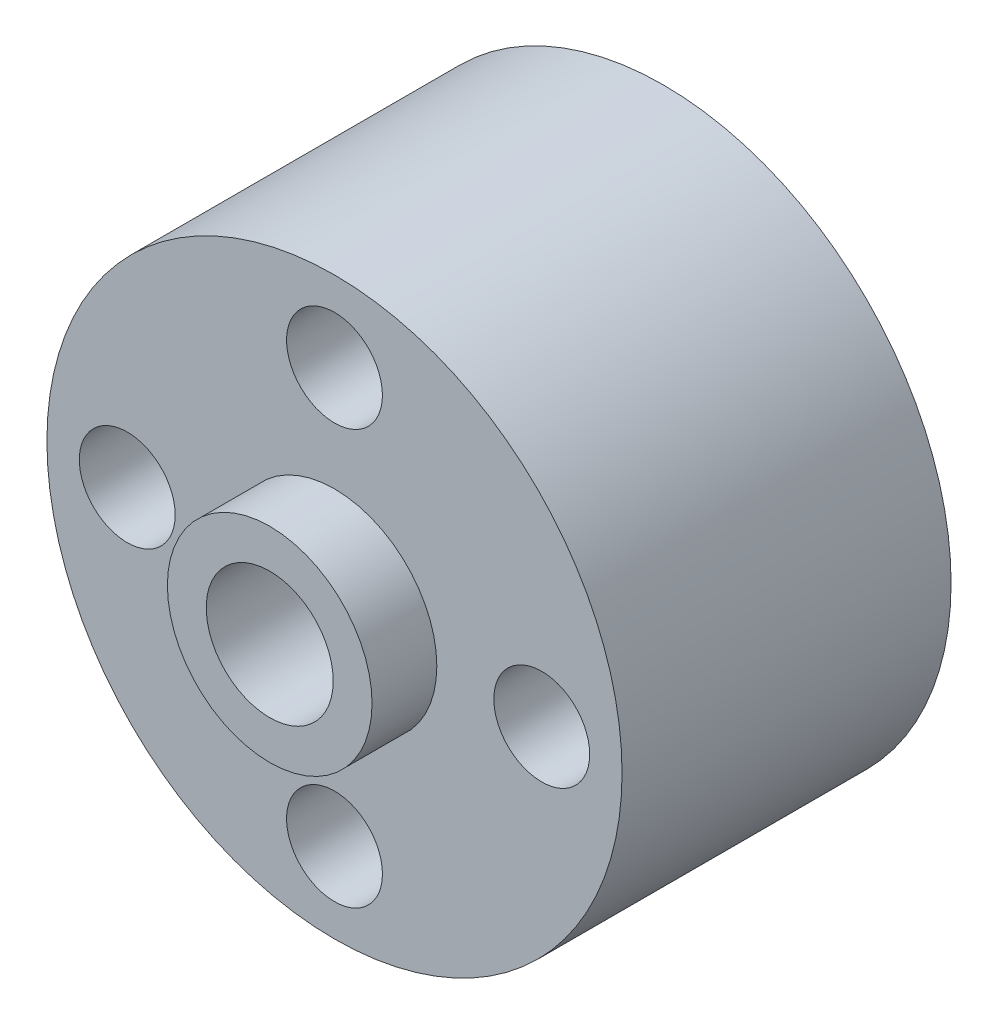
from build123d import *

# Parameters (mm, degrees)
SKETCH1_R          = 11.1
EXTRUDE1_DEPTH     = 12.7
SKETCH3_R          = 1.85
CUT_EXTRUDE1_DEPTH = 21.191830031
SKETCH6_R          = 3.95
EXTRUDE3_DEPTH     = 2.5
EXTRUDE4_START     = 2.5
SKETCH7_R          = 3.95
EXTRUDE4_DEPTH     = 2.5
SKETCH8_R          = 2.45
CUT_EXTRUDE2_DEPTH = 24.658190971


with BuildPart() as part:
    # Sketch1 → Extrude1 (new body)
    with BuildSketch(Plane.XY):
        Circle(SKETCH1_R)
    extrude(amount=-EXTRUDE1_DEPTH)

    # Sketch3 → Cut-Extrude1 (cut, through all)
    with BuildSketch(Plane.XY):
        with Locations((8, 0)):
            Circle(SKETCH3_R)
        with Locations((-8, 0)):
            Circle(SKETCH3_R)
        with Locations((0, -8)):
            Circle(SKETCH3_R)
        with Locations((0, 8)):
            Circle(SKETCH3_R)
    extrude(amount=-CUT_EXTRUDE1_DEPTH, mode=Mode.SUBTRACT)

    # Sketch6 → Extrude3 (add)
    with BuildSketch(Plane.XY):
        Circle(SKETCH6_R)
    extrude(amount=EXTRUDE3_DEPTH)

    # Sketch7 → Extrude4 (add)
    with BuildSketch(Plane(origin=(0, 0, -12.7), x_dir=(-1, 0, 0), z_dir=(0, 0, -1)).offset(EXTRUDE4_START)):
        with Locations(Location((0, 0, 0), (0, 0, 180))):
            Circle(SKETCH7_R)
    extrude(amount=-EXTRUDE4_DEPTH)

    # Sketch8 → Cut-Extrude2 (cut, through all)
    with BuildSketch(Plane.XY.offset(2.5)):
        Circle(SKETCH8_R)
    extrude(amount=-CUT_EXTRUDE2_DEPTH, mode=Mode.SUBTRACT)


solid = part.part
